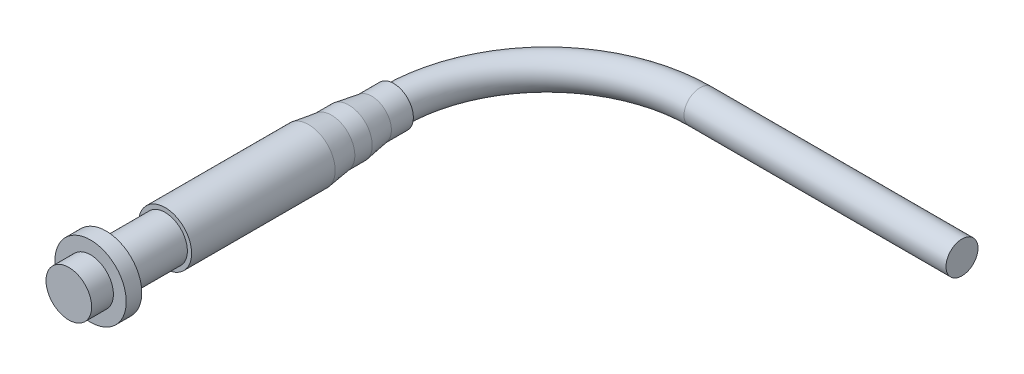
ISO-10303-21;
HEADER;
FILE_DESCRIPTION(('STEP AP214'),'2;1');
FILE_NAME('part.step','',(''),(''),'','','');
FILE_SCHEMA(('AUTOMOTIVE_DESIGN { 1 0 10303 214 1 1 1 1 }'));
ENDSEC;
DATA;
#1=APPLICATION_CONTEXT('core data for automotive mechanical design processes');
#2=APPLICATION_PROTOCOL_DEFINITION('international standard','automotive_design',2000,#1);
#3=PRODUCT_CONTEXT('',#1,'mechanical');
#4=PRODUCT('Part','Part','',(#3));
#5=PRODUCT_RELATED_PRODUCT_CATEGORY('part','',(#4));
#6=PRODUCT_DEFINITION_FORMATION('','',#4);
#7=PRODUCT_DEFINITION_CONTEXT('part definition',#1,'design');
#8=PRODUCT_DEFINITION('design','',#6,#7);
#9=PRODUCT_DEFINITION_SHAPE('','',#8);
#10=(LENGTH_UNIT() NAMED_UNIT(*) SI_UNIT(.MILLI.,.METRE.));
#11=(NAMED_UNIT(*) PLANE_ANGLE_UNIT() SI_UNIT($,.RADIAN.));
#12=(NAMED_UNIT(*) SI_UNIT($,.STERADIAN.) SOLID_ANGLE_UNIT());
#13=UNCERTAINTY_MEASURE_WITH_UNIT(LENGTH_MEASURE(1.E-05),#10,'distance_accuracy_value','');
#14=(GEOMETRIC_REPRESENTATION_CONTEXT(3) GLOBAL_UNCERTAINTY_ASSIGNED_CONTEXT((#13)) GLOBAL_UNIT_ASSIGNED_CONTEXT((#10,
#11,#12)) REPRESENTATION_CONTEXT('',''));
#15=CARTESIAN_POINT('',(0.,0.,0.));
#16=DIRECTION('',(0.,0.,1.));
#17=DIRECTION('',(1.,0.,0.));
#18=AXIS2_PLACEMENT_3D('',#15,#16,#17);
#19=CARTESIAN_POINT('',(0.,0.,12.0904));
#20=DIRECTION('',(0.,0.,1.));
#21=DIRECTION('',(1.,0.,0.));
#22=AXIS2_PLACEMENT_3D('',#19,#20,#21);
#23=PLANE('',#22);
#24=CARTESIAN_POINT('',(0.,0.,12.0904));
#25=DIRECTION('',(0.,0.,-1.));
#26=DIRECTION('',(-1.,0.,0.));
#27=AXIS2_PLACEMENT_3D('',#24,#25,#26);
#28=CIRCLE('',#27,12.6746);
#29=CARTESIAN_POINT('',(-12.6746,0.,12.0904));
#30=VERTEX_POINT('',#29);
#31=EDGE_CURVE('E375',#30,#30,#28,.T.);
#32=ORIENTED_EDGE('',*,*,#31,.F.);
#33=EDGE_LOOP('',(#32));
#34=FACE_BOUND('',#33,.T.);
#35=ADVANCED_FACE('F372',(#34),#23,.T.);
#36=CARTESIAN_POINT('',(0.,0.,-204.828193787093));
#37=DIRECTION('',(0.,0.,-1.));
#38=DIRECTION('',(-1.,0.,0.));
#39=AXIS2_PLACEMENT_3D('',#36,#37,#38);
#40=CYLINDRICAL_SURFACE('',#39,12.6746);
#41=ORIENTED_EDGE('',*,*,#31,.T.);
#42=EDGE_LOOP('',(#41));
#43=FACE_BOUND('',#42,.T.);
#44=CARTESIAN_POINT('',(0.,0.,0.));
#45=DIRECTION('',(0.,0.,-1.));
#46=DIRECTION('',(-1.,0.,0.));
#47=AXIS2_PLACEMENT_3D('',#44,#45,#46);
#48=CIRCLE('',#47,12.6746);
#49=CARTESIAN_POINT('',(-12.6746,0.,0.));
#50=VERTEX_POINT('',#49);
#51=EDGE_CURVE('E383',#50,#50,#48,.T.);
#52=ORIENTED_EDGE('',*,*,#51,.F.);
#53=EDGE_LOOP('',(#52));
#54=FACE_BOUND('',#53,.T.);
#55=ADVANCED_FACE('F426',(#43,#54),#40,.T.);
#56=CARTESIAN_POINT('',(-12.6746,0.,0.));
#57=DIRECTION('',(0.,0.,1.));
#58=DIRECTION('',(1.,0.,0.));
#59=AXIS2_PLACEMENT_3D('',#56,#57,#58);
#60=PLANE('',#59);
#61=ORIENTED_EDGE('',*,*,#51,.T.);
#62=EDGE_LOOP('',(#61));
#63=FACE_BOUND('',#62,.T.);
#64=CARTESIAN_POINT('',(0.,0.,0.));
#65=DIRECTION('',(0.,0.,-1.));
#66=DIRECTION('',(-1.,0.,0.));
#67=AXIS2_PLACEMENT_3D('',#64,#65,#66);
#68=CIRCLE('',#67,19.812);
#69=CARTESIAN_POINT('',(-19.812,0.,0.));
#70=VERTEX_POINT('',#69);
#71=EDGE_CURVE('E418',#70,#70,#68,.T.);
#72=ORIENTED_EDGE('',*,*,#71,.F.);
#73=EDGE_LOOP('',(#72));
#74=FACE_BOUND('',#73,.T.);
#75=ADVANCED_FACE('F423',(#63,#74),#60,.T.);
#76=CARTESIAN_POINT('',(0.,0.,-204.828193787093));
#77=DIRECTION('',(0.,0.,-1.));
#78=DIRECTION('',(-1.,0.,0.));
#79=AXIS2_PLACEMENT_3D('',#76,#77,#78);
#80=CYLINDRICAL_SURFACE('',#79,19.812);
#81=ORIENTED_EDGE('',*,*,#71,.T.);
#82=EDGE_LOOP('',(#81));
#83=FACE_BOUND('',#82,.T.);
#84=CARTESIAN_POINT('',(0.,0.,-8.636));
#85=DIRECTION('',(0.,0.,-1.));
#86=DIRECTION('',(-1.,0.,0.));
#87=AXIS2_PLACEMENT_3D('',#84,#85,#86);
#88=CIRCLE('',#87,19.812);
#89=CARTESIAN_POINT('',(-19.812,0.,-8.636));
#90=VERTEX_POINT('',#89);
#91=EDGE_CURVE('E415',#90,#90,#88,.T.);
#92=ORIENTED_EDGE('',*,*,#91,.F.);
#93=EDGE_LOOP('',(#92));
#94=FACE_BOUND('',#93,.T.);
#95=ADVANCED_FACE('F433',(#83,#94),#80,.T.);
#96=CARTESIAN_POINT('',(-19.812,0.,-8.636));
#97=DIRECTION('',(0.,0.,-1.));
#98=DIRECTION('',(-1.,0.,0.));
#99=AXIS2_PLACEMENT_3D('',#96,#97,#98);
#100=PLANE('',#99);
#101=ORIENTED_EDGE('',*,*,#91,.T.);
#102=EDGE_LOOP('',(#101));
#103=FACE_BOUND('',#102,.T.);
#104=CARTESIAN_POINT('',(0.,0.,-8.636));
#105=DIRECTION('',(0.,0.,-1.));
#106=DIRECTION('',(-1.,0.,0.));
#107=AXIS2_PLACEMENT_3D('',#104,#105,#106);
#108=CIRCLE('',#107,12.3825);
#109=CARTESIAN_POINT('',(-12.3825,0.,-8.636));
#110=VERTEX_POINT('',#109);
#111=EDGE_CURVE('E412',#110,#110,#108,.T.);
#112=ORIENTED_EDGE('',*,*,#111,.F.);
#113=EDGE_LOOP('',(#112));
#114=FACE_BOUND('',#113,.T.);
#115=ADVANCED_FACE('F439',(#103,#114),#100,.T.);
#116=CARTESIAN_POINT('',(0.,0.,-204.828193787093));
#117=DIRECTION('',(0.,0.,-1.));
#118=DIRECTION('',(-1.,0.,0.));
#119=AXIS2_PLACEMENT_3D('',#116,#117,#118);
#120=CYLINDRICAL_SURFACE('',#119,12.3825);
#121=ORIENTED_EDGE('',*,*,#111,.T.);
#122=EDGE_LOOP('',(#121));
#123=FACE_BOUND('',#122,.T.);
#124=CARTESIAN_POINT('',(0.,0.,-41.402));
#125=DIRECTION('',(0.,0.,-1.));
#126=DIRECTION('',(-1.,0.,0.));
#127=AXIS2_PLACEMENT_3D('',#124,#125,#126);
#128=CIRCLE('',#127,12.3825);
#129=CARTESIAN_POINT('',(-12.3825,0.,-41.402));
#130=VERTEX_POINT('',#129);
#131=EDGE_CURVE('E409',#130,#130,#128,.T.);
#132=ORIENTED_EDGE('',*,*,#131,.F.);
#133=EDGE_LOOP('',(#132));
#134=FACE_BOUND('',#133,.T.);
#135=ADVANCED_FACE('F443',(#123,#134),#120,.T.);
#136=CARTESIAN_POINT('',(-14.732,0.,-41.402));
#137=DIRECTION('',(0.,0.,1.));
#138=DIRECTION('',(1.,0.,0.));
#139=AXIS2_PLACEMENT_3D('',#136,#137,#138);
#140=PLANE('',#139);
#141=ORIENTED_EDGE('',*,*,#131,.T.);
#142=EDGE_LOOP('',(#141));
#143=FACE_BOUND('',#142,.T.);
#144=CARTESIAN_POINT('',(0.,0.,-41.402));
#145=DIRECTION('',(0.,0.,-1.));
#146=DIRECTION('',(-1.,0.,0.));
#147=AXIS2_PLACEMENT_3D('',#144,#145,#146);
#148=CIRCLE('',#147,14.732);
#149=CARTESIAN_POINT('',(-14.732,0.,-41.402));
#150=VERTEX_POINT('',#149);
#151=EDGE_CURVE('E406',#150,#150,#148,.T.);
#152=ORIENTED_EDGE('',*,*,#151,.F.);
#153=EDGE_LOOP('',(#152));
#154=FACE_BOUND('',#153,.T.);
#155=ADVANCED_FACE('F447',(#143,#154),#140,.T.);
#156=CARTESIAN_POINT('',(0.,0.,-204.828193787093));
#157=DIRECTION('',(0.,0.,-1.));
#158=DIRECTION('',(-1.,0.,0.));
#159=AXIS2_PLACEMENT_3D('',#156,#157,#158);
#160=CYLINDRICAL_SURFACE('',#159,14.732);
#161=ORIENTED_EDGE('',*,*,#151,.T.);
#162=EDGE_LOOP('',(#161));
#163=FACE_BOUND('',#162,.T.);
#164=CARTESIAN_POINT('',(0.,0.,-121.158));
#165=DIRECTION('',(0.,0.,-1.));
#166=DIRECTION('',(-1.,0.,0.));
#167=AXIS2_PLACEMENT_3D('',#164,#165,#166);
#168=CIRCLE('',#167,14.732);
#169=CARTESIAN_POINT('',(-14.732,0.,-121.158));
#170=VERTEX_POINT('',#169);
#171=EDGE_CURVE('E403',#170,#170,#168,.T.);
#172=ORIENTED_EDGE('',*,*,#171,.F.);
#173=EDGE_LOOP('',(#172));
#174=FACE_BOUND('',#173,.T.);
#175=ADVANCED_FACE('F451',(#163,#174),#160,.T.);
#176=CARTESIAN_POINT('',(0.,0.,-133.858));
#177=DIRECTION('',(0.,0.,1.));
#178=DIRECTION('',(1.,0.,0.));
#179=AXIS2_PLACEMENT_3D('',#176,#177,#178);
#180=CONICAL_SURFACE('',#179,12.954,0.139095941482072);
#181=ORIENTED_EDGE('',*,*,#171,.T.);
#182=EDGE_LOOP('',(#181));
#183=FACE_BOUND('',#182,.T.);
#184=CARTESIAN_POINT('',(0.,0.,-133.858));
#185=DIRECTION('',(0.,0.,-1.));
#186=DIRECTION('',(-1.,0.,0.));
#187=AXIS2_PLACEMENT_3D('',#184,#185,#186);
#188=CIRCLE('',#187,12.954);
#189=CARTESIAN_POINT('',(-12.954,0.,-133.858));
#190=VERTEX_POINT('',#189);
#191=EDGE_CURVE('E400',#190,#190,#188,.T.);
#192=ORIENTED_EDGE('',*,*,#191,.F.);
#193=EDGE_LOOP('',(#192));
#194=FACE_BOUND('',#193,.T.);
#195=ADVANCED_FACE('F455',(#183,#194),#180,.T.);
#196=CARTESIAN_POINT('',(0.,0.,-204.828193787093));
#197=DIRECTION('',(0.,0.,-1.));
#198=DIRECTION('',(-1.,0.,0.));
#199=AXIS2_PLACEMENT_3D('',#196,#197,#198);
#200=CYLINDRICAL_SURFACE('',#199,12.954);
#201=ORIENTED_EDGE('',*,*,#191,.T.);
#202=EDGE_LOOP('',(#201));
#203=FACE_BOUND('',#202,.T.);
#204=CARTESIAN_POINT('',(0.,0.,-143.51));
#205=DIRECTION('',(0.,0.,-1.));
#206=DIRECTION('',(-1.,0.,0.));
#207=AXIS2_PLACEMENT_3D('',#204,#205,#206);
#208=CIRCLE('',#207,12.954);
#209=CARTESIAN_POINT('',(-12.954,0.,-143.51));
#210=VERTEX_POINT('',#209);
#211=EDGE_CURVE('E397',#210,#210,#208,.T.);
#212=ORIENTED_EDGE('',*,*,#211,.F.);
#213=EDGE_LOOP('',(#212));
#214=FACE_BOUND('',#213,.T.);
#215=ADVANCED_FACE('F459',(#203,#214),#200,.T.);
#216=CARTESIAN_POINT('',(0.,0.,-156.21));
#217=DIRECTION('',(0.,0.,1.));
#218=DIRECTION('',(1.,0.,0.));
#219=AXIS2_PLACEMENT_3D('',#216,#217,#218);
#220=CONICAL_SURFACE('',#219,10.922,0.158655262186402);
#221=ORIENTED_EDGE('',*,*,#211,.T.);
#222=EDGE_LOOP('',(#221));
#223=FACE_BOUND('',#222,.T.);
#224=CARTESIAN_POINT('',(0.,0.,-156.21));
#225=DIRECTION('',(0.,0.,-1.));
#226=DIRECTION('',(-1.,0.,0.));
#227=AXIS2_PLACEMENT_3D('',#224,#225,#226);
#228=CIRCLE('',#227,10.922);
#229=CARTESIAN_POINT('',(-10.922,0.,-156.21));
#230=VERTEX_POINT('',#229);
#231=EDGE_CURVE('E394',#230,#230,#228,.T.);
#232=ORIENTED_EDGE('',*,*,#231,.F.);
#233=EDGE_LOOP('',(#232));
#234=FACE_BOUND('',#233,.T.);
#235=ADVANCED_FACE('F463',(#223,#234),#220,.T.);
#236=CARTESIAN_POINT('',(0.,0.,-204.828193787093));
#237=DIRECTION('',(0.,0.,-1.));
#238=DIRECTION('',(-1.,0.,0.));
#239=AXIS2_PLACEMENT_3D('',#236,#237,#238);
#240=CYLINDRICAL_SURFACE('',#239,10.922);
#241=ORIENTED_EDGE('',*,*,#231,.T.);
#242=EDGE_LOOP('',(#241));
#243=FACE_BOUND('',#242,.T.);
#244=CARTESIAN_POINT('',(0.,0.,-168.402));
#245=DIRECTION('',(0.,0.,-1.));
#246=DIRECTION('',(-1.,0.,0.));
#247=AXIS2_PLACEMENT_3D('',#244,#245,#246);
#248=CIRCLE('',#247,10.922);
#249=CARTESIAN_POINT('',(-10.922,0.,-168.402));
#250=VERTEX_POINT('',#249);
#251=EDGE_CURVE('E391',#250,#250,#248,.T.);
#252=ORIENTED_EDGE('',*,*,#251,.F.);
#253=EDGE_LOOP('',(#252));
#254=FACE_BOUND('',#253,.T.);
#255=ADVANCED_FACE('F467',(#243,#254),#240,.T.);
#256=CARTESIAN_POINT('',(-10.922,0.,-168.402));
#257=DIRECTION('',(0.,0.,-1.));
#258=DIRECTION('',(-1.,0.,0.));
#259=AXIS2_PLACEMENT_3D('',#256,#257,#258);
#260=PLANE('',#259);
#261=CARTESIAN_POINT('',(0.,0.,-168.402));
#262=DIRECTION('',(0.,0.,-1.));
#263=DIRECTION('',(-1.,0.,0.));
#264=AXIS2_PLACEMENT_3D('',#261,#262,#263);
#265=CIRCLE('',#264,8.89);
#266=CARTESIAN_POINT('',(-8.89000000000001,0.,-168.402));
#267=VERTEX_POINT('',#266);
#268=EDGE_CURVE('E10',#267,#267,#265,.T.);
#269=ORIENTED_EDGE('',*,*,#268,.F.);
#270=EDGE_LOOP('',(#269));
#271=FACE_BOUND('',#270,.T.);
#272=ORIENTED_EDGE('',*,*,#251,.T.);
#273=EDGE_LOOP('',(#272));
#274=FACE_BOUND('',#273,.T.);
#275=ADVANCED_FACE('F471',(#271,#274),#260,.T.);
#276=CARTESIAN_POINT('',(85.0900000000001,0.,-253.492));
#277=DIRECTION('',(1.,0.,0.));
#278=DIRECTION('',(0.,0.,-1.));
#279=AXIS2_PLACEMENT_3D('',#276,#277,#278);
#280=CYLINDRICAL_SURFACE('',#279,8.89);
#281=CARTESIAN_POINT('',(85.0900000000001,0.,-253.492));
#282=DIRECTION('',(1.,0.,0.));
#283=DIRECTION('',(0.,0.,-1.));
#284=AXIS2_PLACEMENT_3D('',#281,#282,#283);
#285=CIRCLE('',#284,8.89);
#286=CARTESIAN_POINT('',(85.0900000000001,0.,-262.382));
#287=VERTEX_POINT('',#286);
#288=EDGE_CURVE('E385',#287,#287,#285,.T.);
#289=ORIENTED_EDGE('',*,*,#288,.T.);
#290=EDGE_LOOP('',(#289));
#291=FACE_BOUND('',#290,.T.);
#292=CARTESIAN_POINT('',(230.633986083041,0.,-253.492));
#293=DIRECTION('',(1.,0.,0.));
#294=DIRECTION('',(0.,0.,-1.));
#295=AXIS2_PLACEMENT_3D('',#292,#293,#294);
#296=CIRCLE('',#295,8.89);
#297=CARTESIAN_POINT('',(230.633986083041,0.,-262.382));
#298=VERTEX_POINT('',#297);
#299=EDGE_CURVE('E388',#298,#298,#296,.T.);
#300=ORIENTED_EDGE('',*,*,#299,.F.);
#301=EDGE_LOOP('',(#300));
#302=FACE_BOUND('',#301,.T.);
#303=ADVANCED_FACE('F475',(#291,#302),#280,.T.);
#304=CARTESIAN_POINT('',(85.09,0.,-168.402));
#305=DIRECTION('',(0.,1.,0.));
#306=DIRECTION('',(0.,0.,1.));
#307=AXIS2_PLACEMENT_3D('',#304,#305,#306);
#308=TOROIDAL_SURFACE('',#307,85.09,8.89);
#309=CARTESIAN_POINT('',(85.09,0.,-168.402));
#310=DIRECTION('',(0.,1.,0.));
#311=DIRECTION('',(0.,0.,1.));
#312=AXIS2_PLACEMENT_3D('',#309,#310,#311);
#313=CIRCLE('',#312,93.98);
#314=EDGE_CURVE('',#287,#267,#313,.T.);
#315=ORIENTED_EDGE('',*,*,#288,.F.);
#316=ORIENTED_EDGE('',*,*,#268,.T.);
#317=ORIENTED_EDGE('',*,*,#314,.T.);
#318=ORIENTED_EDGE('',*,*,#314,.F.);
#319=EDGE_LOOP('',(#315,#317,#316,#318));
#320=FACE_BOUND('',#319,.T.);
#321=ADVANCED_FACE('F479',(#320),#308,.T.);
#322=CARTESIAN_POINT('',(230.633986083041,0.,-253.492));
#323=DIRECTION('',(1.,0.,0.));
#324=DIRECTION('',(0.,0.,-1.));
#325=AXIS2_PLACEMENT_3D('',#322,#323,#324);
#326=PLANE('',#325);
#327=ORIENTED_EDGE('',*,*,#299,.T.);
#328=EDGE_LOOP('',(#327));
#329=FACE_BOUND('',#328,.T.);
#330=ADVANCED_FACE('F481',(#329),#326,.T.);
#331=CLOSED_SHELL('',(#35,#55,#75,#95,#115,#135,#155,#175,#195,#215,#235,#255,#275,#303,#321,#330));
#332=MANIFOLD_SOLID_BREP('B2',#331);
#333=ADVANCED_BREP_SHAPE_REPRESENTATION('',(#18,#332),#14);
#334=SHAPE_DEFINITION_REPRESENTATION(#9,#333);
ENDSEC;
END-ISO-10303-21;
